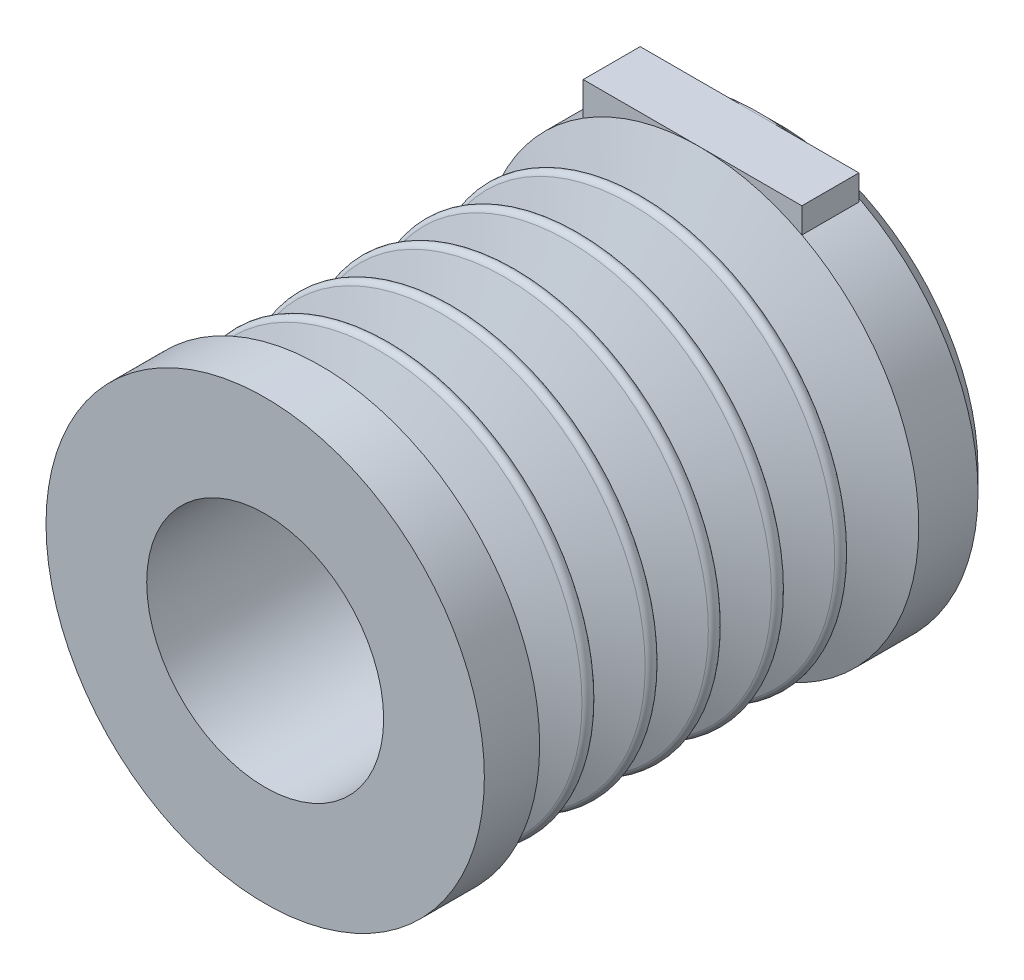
from build123d import *

# Parameters (mm, degrees)
CONG_1_R                = 0.15
CONG_2_R                = 0.2
CHANFREIN1_SIZE         = 0.5
BOSS_EXTRU_1_REACH      = 19.973
BOSS_EXTRU_1_END_RADIUS = 5.55
ESQUISSE2_W             = 5.538073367
ESQUISSE2_H             = 1.443485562


with BuildPart() as part:
    # Esquisse1 → corps (revolve)
    with BuildSketch(Plane(origin=(0, 0, 0), x_dir=(0, 0, -1), z_dir=(1, 0, 0)), mode=Mode.PRIVATE) as corps_sk:
        Polygon((0, 5.55), (0, 3), (-13, 3), (-13, 5.55), (-11.6, 5.55), (-10.8, 3.352018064), (-10, 5.55), (-9.2, 3.352018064), (-8.4, 5.55), (-7.6, 3.352018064), (-6.8, 5.55), (-6, 3.352018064), (-5.2, 5.55), (-4.4, 3.352018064), (-3.6, 5.55), (-2.8, 3.352018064), (-2, 5.55), align=None)
    revolve(corps_sk.sketch.rotate(Axis((0, 0, 21.5), (0, 0, -1)), 90), axis=Axis((0, 0, 21.5), (0, 0, -1)))

    # Cong_1
    cong_1_edges = [part.edges().sort_by_distance(p)[0] for p in [
        (-5.55, 0, 10),
        (-5.55, 0, 8.4),
        (-5.55, 0, 6.8),
        (-5.55, 0, 5.2),
        (-5.55, 0, 3.6),
    ]]
    fillet(cong_1_edges, radius=CONG_1_R)

    # Cong_2
    cong_2_edges = [part.edges().sort_by_distance(p)[0] for p in [
        (-3.352018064, 0, 10.8),
        (-3.352018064, 0, 9.2),
        (-3.352018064, 0, 7.6),
        (-3.352018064, 0, 6),
        (-3.352018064, 0, 4.4),
        (-3.352018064, 0, 2.8),
    ]]
    fillet(cong_2_edges, radius=CONG_2_R)

    # Chanfrein1
    chanfrein1_edges = [part.edges().sort_by_distance(p)[0] for p in [
        (-5.55, 0, 0),
    ]]
    chamfer(chanfrein1_edges, length=CHANFREIN1_SIZE)

    # Boss.-Extru.1: up to this cylinder (the profile starts outside it)
    boss_extru_1_end = Plane(origin=(0, 0, 1.278257), z_dir=(0, 0, 1)) * Cylinder(BOSS_EXTRU_1_END_RADIUS, 52.046, mode=Mode.PRIVATE)
    # Esquisse2 → Boss.-Extru.1 (add, up to the surface)
    with BuildSketch(Plane(origin=(0, 5.55, 0), x_dir=(-1, 0, 0), z_dir=(0, 1, 0)), mode=Mode.PRIVATE) as boss_extru_1_sk1:
        with Locations((0.178415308, 1.278257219)):
            Rectangle(ESQUISSE2_W, ESQUISSE2_H)
    boss_extru_1_tool1 = extrude(boss_extru_1_sk1.sketch, amount=-BOSS_EXTRU_1_REACH, mode=Mode.PRIVATE) - boss_extru_1_end
    add(boss_extru_1_tool1.solids().sort_by_distance((-0.178415, 5.55, 1.278257))[0])
    add(boss_extru_1_tool1.solids().sort_by_distance((-0.178415, 5.55, 1.278257))[1])


solid = part.part
